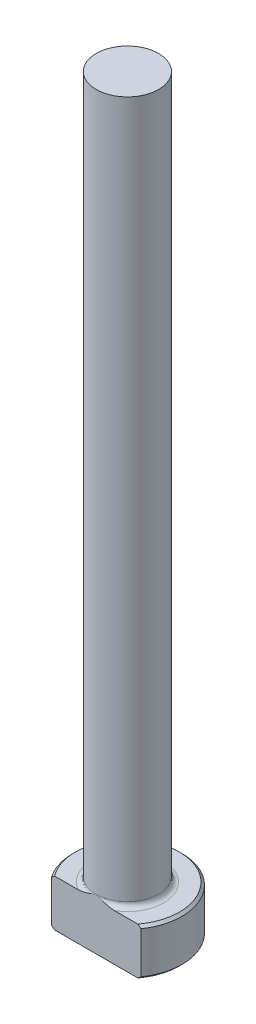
from build123d import *

# Parameters (mm, degrees)
CHAMFER1_SIZE = 0.254
FILLET1_R     = 0.508
KEY_DEPTH     = 77.603151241


with BuildPart() as part:
    # Sketch1 → Revolve1 (revolve)
    with BuildSketch(Plane.XY, mode=Mode.PRIVATE) as revolve1_sk:
        Polygon((0, 0), (-5.5499, 0), (-5.5499, 4.7498), (-3.175, 4.7498), (-3.175, 76.2), (0, 76.2), align=None)
    revolve(revolve1_sk.sketch.rotate(Axis((0, 259.958771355, 0), (0, -1, 0)), 270), axis=Axis((0, 259.958771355, 0), (0, -1, 0)))

    # Chamfer1
    chamfer1_edges = [part.edges().sort_by_distance(p)[0] for p in [
        (0, 4.7498, -5.5499),
        (0, 0, -5.5499),
    ]]
    chamfer(chamfer1_edges, length=CHAMFER1_SIZE)

    # Fillet1
    fillet1_edges = [part.edges().sort_by_distance(p)[0] for p in [
        (0, 4.7498, -3.175),
    ]]
    fillet(fillet1_edges, radius=FILLET1_R)

    # Sketch2 → KEY (cut, through all)
    with BuildSketch(Plane.XZ):
        with BuildLine():
            Line((-4.552006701, 3.175), (4.552006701, 3.175))
            ThreePointArc((4.552006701, 3.175), (0, 5.5499), (-4.552006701, 3.175))
        make_face()
    extrude(amount=-KEY_DEPTH, mode=Mode.SUBTRACT)


solid = part.part
